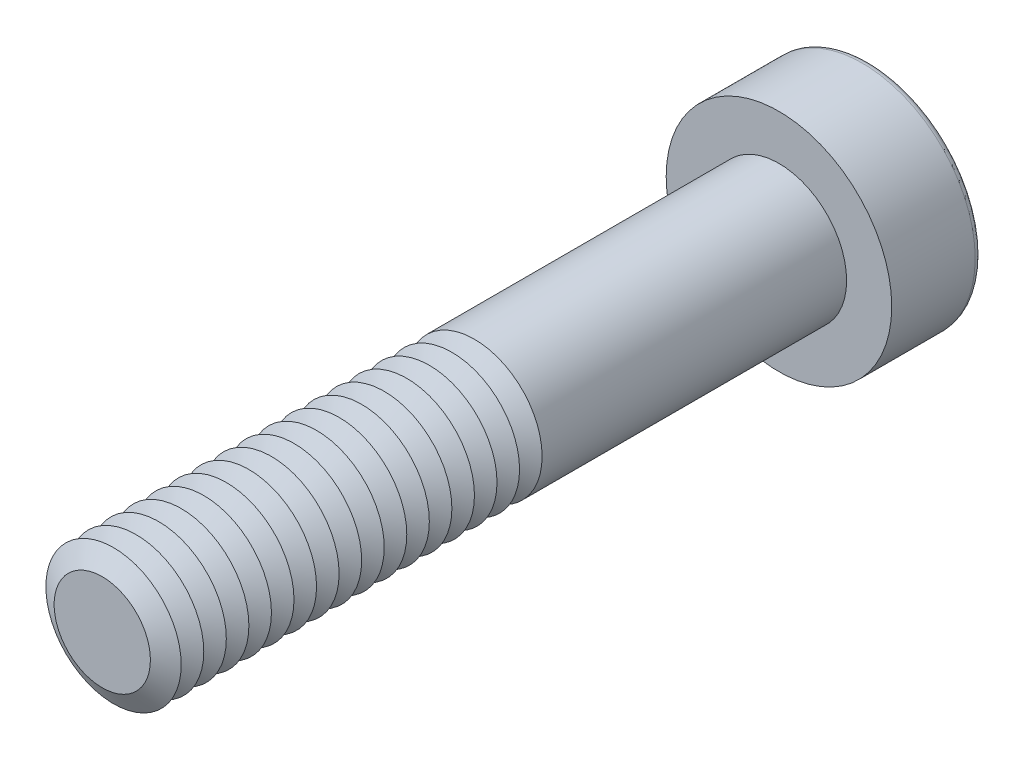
from build123d import *

# Parameters (mm, degrees)
SKETCH1_R           = 3
BOSS_EXTRUDE1_DEPTH = 30
SKETCH2_R           = 5
BOSS_EXTRUDE2_DEPTH = 4
CUT_EXTRUDE1_DEPTH  = 3
FILLET1_R           = 0.3
LPATTERN1_COUNT     = 17
LPATTERN1_PITCH     = 1


with BuildPart() as part:
    # Sketch1 → Boss-Extrude1 (new body)
    with BuildSketch(Plane.XY):
        Circle(SKETCH1_R)
    extrude(amount=BOSS_EXTRUDE1_DEPTH)

    # Sketch2 → Boss-Extrude2 (add)
    with BuildSketch(Plane(origin=(0, 0, 0), x_dir=(-1, 0, 0), z_dir=(0, 0, -1))):
        Circle(SKETCH2_R)
    extrude(amount=BOSS_EXTRUDE2_DEPTH)

    # Sketch3 → Cut-Extrude1 (cut)
    with BuildSketch(Plane(origin=(0, 0, -4), x_dir=(-1, 0, 0), z_dir=(0, 0, -1))):
        Polygon((-1.154700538, 2), (-2.309401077, 0), (-1.154700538, -2), (1.154700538, -2), (2.309401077, 0), (1.154700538, 2), align=None)
    extrude(amount=-CUT_EXTRUDE1_DEPTH, mode=Mode.SUBTRACT)

    # Fillet1
    fillet1_edges = [part.edges().sort_by_distance(p)[0] for p in [
        (5, 0, -4),
    ]]
    fillet(fillet1_edges, radius=FILLET1_R)

    # Cut-Extrude2 cone 1 section (on through the dimple's axis) → Cut-Extrude2 (revolve, cut)
    with BuildSketch(Plane(origin=(0, 0, -1), x_dir=(0, 1, 0), z_dir=(1, 0, 0))):
        Polygon((0, 0), (2, 0), (0, 1.154700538), align=None)
    revolve(axis=Axis((0, 0, -1), (0, 0, 1)), mode=Mode.SUBTRACT)

    # Cut-Extrude3 cone 1 section (on through the dimple's axis) → Cut-Extrude3 (revolve, cut)
    with BuildSketch(Plane(origin=(0, 0, -4), x_dir=(0, 1, 0), z_dir=(1, 0, 0))):
        Polygon((0, 0), (2.309401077, 0), (0, 0.618802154), align=None)
    revolve(axis=Axis((0, 0, -4), (0, 0, 1)), mode=Mode.SUBTRACT)

    # Sketch7 → Cut-Revolve1 (revolve, cut)
    with BuildSketch(Plane(origin=(0, 0, 0), x_dir=(0, 0, -1), z_dir=(1, 0, 0)), mode=Mode.PRIVATE) as cut_revolve1_sk:
        Polygon((-30, 2.133974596), (-29.5, 3), (-30.5, 3), align=None)
    cut_revolve1 = revolve(cut_revolve1_sk.sketch.rotate(Axis((0, 0, 30), (0, 0, -1)), 90), axis=Axis((0, 0, 30), (0, 0, -1)), mode=Mode.SUBTRACT)

    # LPattern1: Cut-Revolve1 ×17
    with Locations(*[(0, 0, -i * LPATTERN1_PITCH) for i in range(1, LPATTERN1_COUNT)]):
        add(cut_revolve1, mode=Mode.SUBTRACT)


solid = part.part
